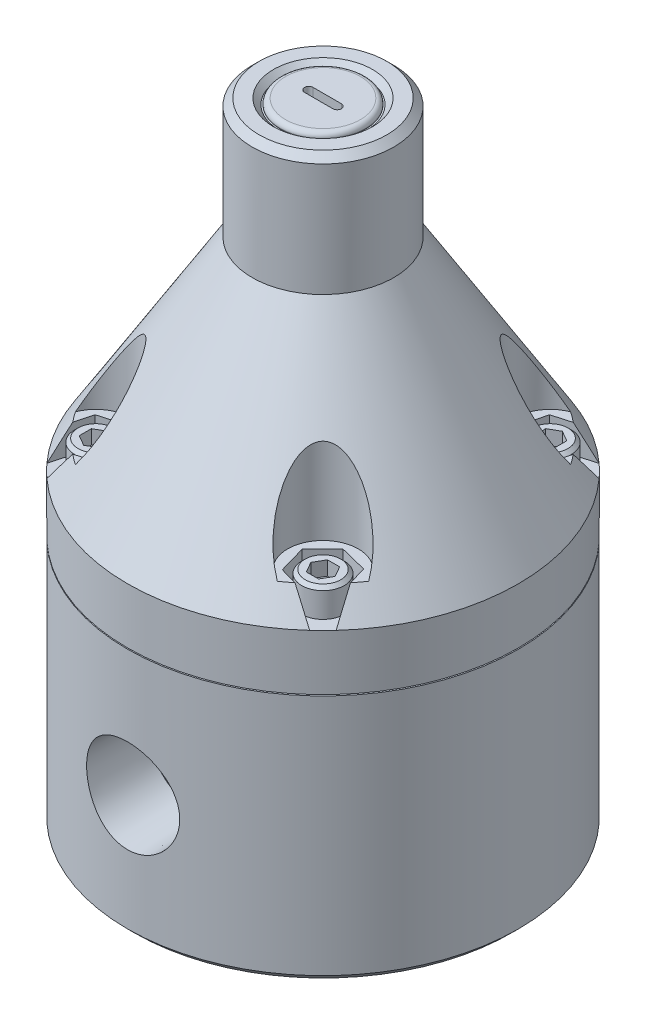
from build123d import *

# Parameters (mm, degrees)
SKETCH1_R         = 43.815
EXTRUDE1_DEPTH    = 140.97
SKETCH3_R         = 11.1125
EXTRUDE2_DEPTH    = 1.27
EXTRUDE2_DRAFT    = -45
CHAMFER1_SIZE     = 1.5748
SKETCH4_R         = 9.525
EXTRUDE3_DEPTH    = 1.27
FILLET1_R         = 1.143
EXTRUDE4_DEPTH    = 3.302
EXTRUDE4_DRAFT    = -1
SKETCH6_R         = 7.9375
EXTRUDE5_DEPTH    = 22.86
EXTRUDE6_DEPTH    = 6.35
CIRPATTERN1_COUNT = 4
SKETCH9_R         = 4.7625
EXTRUDE7_DEPTH    = 6.35
EXTRUDE8_DEPTH    = 3.175
CIRPATTERN2_COUNT = 4
CHAMFER2_SIZE     = 0.762


with BuildPart() as part:
    # Sketch1 → Extrude1 (new body)
    with BuildSketch(Plane(origin=(0, 0, 0), x_dir=(1, 0, 0), z_dir=(0, 1, 0))):
        with Locations(Location((0, 0, 0), (0, 0, 270))):
            Circle(SKETCH1_R)
    extrude(amount=EXTRUDE1_DEPTH)

    # Sketch2 → Cut-Revolve1 (revolve, cut)
    with BuildSketch(Plane.XY, mode=Mode.PRIVATE) as cut_revolve1_sk:
        Polygon((-43.815, 56.134), (-43.815, 68.58), (-15.875, 114.046), (-15.875, 147.034008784), (-49.44729897, 147.034008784), (-49.44729897, 55.88), (-30.226, 55.88), (-30.226, 56.134), align=None)
    revolve(cut_revolve1_sk.sketch.rotate(Axis((0, 0, 0), (0, 1, 0)), 270), axis=Axis((0, 0, 0), (0, 1, 0)), mode=Mode.SUBTRACT)


with BuildPart() as extrude2_tool:
    # Sketch3 → Extrude2 (with draft: the straight prism first)
    with BuildSketch(Plane(origin=(0, 140.97, 0), x_dir=(-1, 0, 0), z_dir=(0, 1, 0))):
        Circle(SKETCH3_R)
    extrude(amount=-EXTRUDE2_DEPTH)
    # Extrude2: the draft: its side faces are tilted about the plane it starts from
    extrude2_sides = [extrude2_tool.faces().sort_by_distance(p)[0] for p in [
        (11.1125, 140.335, 0),
    ]]
    draft(extrude2_sides, Plane(origin=(0, 140.97, 0), x_dir=(-1, 0, 0), z_dir=(0, 1, 0)), EXTRUDE2_DRAFT)


with BuildPart() as part_1:
    add(part.part)

    # Extrude2: cut by extrude2_tool
    add(extrude2_tool.part, mode=Mode.SUBTRACT)

    # Chamfer1
    chamfer1_edges = [part_1.edges().sort_by_distance(p)[0] for p in [
        (0, 0, -43.815),
        (0, 140.97, 15.875),
    ]]
    chamfer(chamfer1_edges, length=CHAMFER1_SIZE)

    # Sketch4 → Extrude3 (add)
    with BuildSketch(Plane(origin=(0, 140.97, 0), x_dir=(-1, 0, 0), z_dir=(0, 1, 0))):
        with Locations(Location((0, 0, 0), (0, 0, 90))):
            Circle(SKETCH4_R)
    extrude(amount=-EXTRUDE3_DEPTH)

    # Fillet1
    fillet1_edges = [part_1.edges().sort_by_distance(p)[0] for p in [
        (0, 140.97, -9.525),
    ]]
    fillet(fillet1_edges, radius=FILLET1_R)


with BuildPart() as extrude4_tool:
    # Sketch5 → Extrude4 (with draft: the straight prism first)
    with BuildSketch(Plane(origin=(0, 140.97, 0), x_dir=(-1, 0, 0), z_dir=(0, 1, 0))):
        with BuildLine():
            Line((3.175, 0.9652), (-3.175, 0.9652))
            ThreePointArc((-3.175, 0.9652), (-4.1402, 0), (-3.175, -0.9652))
            Line((-3.175, -0.9652), (3.175, -0.9652))
            ThreePointArc((3.175, -0.9652), (4.1402, 0), (3.175, 0.9652))
        make_face()
    extrude(amount=-EXTRUDE4_DEPTH)
    # Extrude4: the draft: its side faces are tilted about the plane it starts from
    extrude4_sides = [extrude4_tool.faces().sort_by_distance(p)[0] for p in [
        (-4.1402, 139.319, 0),
        (0, 139.319, 0.9652),
        (4.1402, 139.319, 0),
        (0, 139.319, -0.9652),
    ]]
    draft(extrude4_sides, Plane(origin=(0, 140.97, 0), x_dir=(-1, 0, 0), z_dir=(0, 1, 0)), EXTRUDE4_DRAFT)


with BuildPart() as part_2:
    add(part_1.part)

    # Extrude4: cut by extrude4_tool
    add(extrude4_tool.part, mode=Mode.SUBTRACT)

    # Sketch6 → Extrude5 (cut)
    with BuildSketch(Plane(origin=(0, 74.93, 0), x_dir=(-1, 0, 0), z_dir=(0, 1, 0))):
        with Locations((-25.459026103, 25.459026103)):
            Circle(SKETCH6_R)
    extrude5 = extrude(amount=EXTRUDE5_DEPTH, mode=Mode.SUBTRACT)

    # Sketch8 → Extrude6 (cut)
    with BuildSketch(Plane(origin=(0, 74.93, 0), x_dir=(-1, 0, 0), z_dir=(0, 1, 0))):
        Polygon((-29.948607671, 20.824591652), (-23.690278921, 19.253717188), (-19.200697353, 23.888151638), (-20.969444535, 30.093460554), (-33.591654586, 33.591654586), align=None)
    extrude6 = extrude(amount=-EXTRUDE6_DEPTH, mode=Mode.SUBTRACT)

    # CirPattern1: Extrude5, Extrude6 ×4 about axis
    cirpattern1_axis = Axis((0, 0, 0), (0, 1, 0))
    add([extrude5.rotate(cirpattern1_axis, i * 360 / CIRPATTERN1_COUNT) for i in range(1, CIRPATTERN1_COUNT)], mode=Mode.SUBTRACT)
    add([extrude6.rotate(cirpattern1_axis, i * 360 / CIRPATTERN1_COUNT) for i in range(1, CIRPATTERN1_COUNT)], mode=Mode.SUBTRACT)

    # Sketch9 → Extrude7 (add)
    with BuildSketch(Plane(origin=(0, 74.93, 0), x_dir=(-1, 0, 0), z_dir=(0, 1, 0))):
        with Locations(Location((-25.459026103, 25.459026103, 0), (0, 0, 90))):
            Circle(SKETCH9_R)
    extrude7 = extrude(amount=-EXTRUDE7_DEPTH)

    # Sketch10 → Extrude8 (cut)
    with BuildSketch(Plane(origin=(0, 74.93, 0), x_dir=(-1, 0, 0), z_dir=(0, 1, 0))):
        Polygon((-28.187127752, 25.459026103), (-26.823076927, 23.096420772), (-24.094975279, 23.096420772), (-22.730924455, 25.459026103), (-24.094975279, 27.821631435), (-26.823076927, 27.821631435), align=None)
    extrude8 = extrude(amount=-EXTRUDE8_DEPTH, mode=Mode.SUBTRACT)

    # CirPattern2: Extrude7, Extrude8 ×4 about axis
    cirpattern2_axis = Axis((0, 0, 0), (0, 1, 0))
    add([extrude7.rotate(cirpattern2_axis, i * 360 / CIRPATTERN2_COUNT) for i in range(1, CIRPATTERN2_COUNT)])
    add([extrude8.rotate(cirpattern2_axis, i * 360 / CIRPATTERN2_COUNT) for i in range(1, CIRPATTERN2_COUNT)], mode=Mode.SUBTRACT)

    # Chamfer2
    chamfer2_edges = [part_2.edges().sort_by_distance(p)[0] for p in [
        (25.459026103, 74.93, 20.696526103),
        (-20.696526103, 74.93, 25.459026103),
        (-25.459026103, 74.93, -20.696526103),
        (20.696526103, 74.93, -25.459026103),
    ]]
    chamfer(chamfer2_edges, length=CHAMFER2_SIZE)

    # Sketch14 → 1_2 Rc Tapped Hole1 (revolve, cut)
    with BuildSketch(Plane(origin=(0, 27.432, 43.815), x_dir=(0, -1, 0), z_dir=(1, 0, 0))):
        Polygon((0, 0), (0, 27.754368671), (8.75, 24.13), (8.75, 14.986), (10.009250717, 14.986), (10.477063, 0), align=None)
    f_1_2_rc_tapped_hole1 = revolve(axis=Axis((0, 27.432, 50.165), (0, 0, -1)), mode=Mode.SUBTRACT)

    # Mirror1: 1_2 Rc Tapped Hole1 across plane
    add(f_1_2_rc_tapped_hole1.mirror(Plane.XY), mode=Mode.SUBTRACT)


solid = part_2.part
